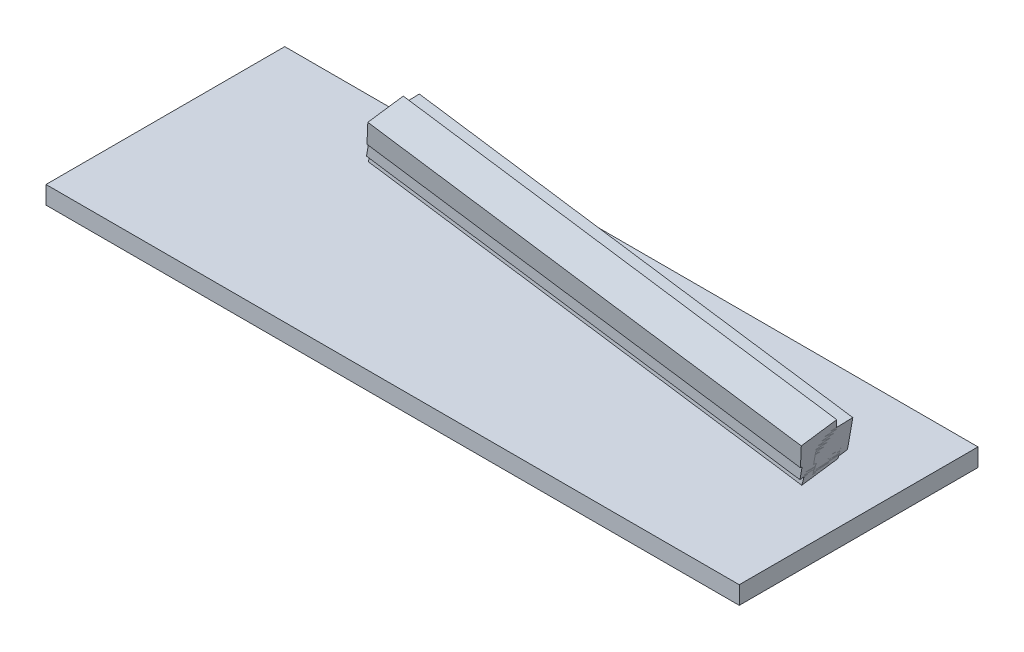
ISO-10303-21;
HEADER;
FILE_DESCRIPTION(('STEP AP214'),'2;1');
FILE_NAME('part.step','',(''),(''),'','','');
FILE_SCHEMA(('AUTOMOTIVE_DESIGN { 1 0 10303 214 1 1 1 1 }'));
ENDSEC;
DATA;
#1=APPLICATION_CONTEXT('core data for automotive mechanical design processes');
#2=APPLICATION_PROTOCOL_DEFINITION('international standard','automotive_design',2000,#1);
#3=PRODUCT_CONTEXT('',#1,'mechanical');
#4=PRODUCT('Part','Part','',(#3));
#5=PRODUCT_RELATED_PRODUCT_CATEGORY('part','',(#4));
#6=PRODUCT_DEFINITION_FORMATION('','',#4);
#7=PRODUCT_DEFINITION_CONTEXT('part definition',#1,'design');
#8=PRODUCT_DEFINITION('design','',#6,#7);
#9=PRODUCT_DEFINITION_SHAPE('','',#8);
#10=(LENGTH_UNIT() NAMED_UNIT(*) SI_UNIT(.MILLI.,.METRE.));
#11=(NAMED_UNIT(*) PLANE_ANGLE_UNIT() SI_UNIT($,.RADIAN.));
#12=(NAMED_UNIT(*) SI_UNIT($,.STERADIAN.) SOLID_ANGLE_UNIT());
#13=UNCERTAINTY_MEASURE_WITH_UNIT(LENGTH_MEASURE(1.E-05),#10,'distance_accuracy_value','');
#14=(GEOMETRIC_REPRESENTATION_CONTEXT(3) GLOBAL_UNCERTAINTY_ASSIGNED_CONTEXT((#13)) GLOBAL_UNIT_ASSIGNED_CONTEXT((#10,
#11,#12)) REPRESENTATION_CONTEXT('',''));
#15=CARTESIAN_POINT('',(0.,0.,0.));
#16=DIRECTION('',(0.,0.,1.));
#17=DIRECTION('',(1.,0.,0.));
#18=AXIS2_PLACEMENT_3D('',#15,#16,#17);
#19=CARTESIAN_POINT('',(-120.032555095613,15.812526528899,2.87336814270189));
#20=DIRECTION('',(-0.0706290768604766,-0.269518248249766,-0.960401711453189));
#21=DIRECTION('',(0.,0.962806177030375,-0.270193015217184));
#22=AXIS2_PLACEMENT_3D('',#19,#20,#21);
#23=PLANE('',#22);
#24=DIRECTION('',(0.15863550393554,0.947517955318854,-0.277568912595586));
#25=VECTOR('',#24,1.);
#26=CARTESIAN_POINT('',(-1.85562473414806,-4.82246293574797,-0.0266905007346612));
#27=LINE('',#26,#25);
#28=CARTESIAN_POINT('',(-2.33644893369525,-7.69438978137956,0.814620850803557));
#29=VERTEX_POINT('',#28);
#30=CARTESIAN_POINT('',(-1.85562473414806,-4.82246293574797,-0.0266905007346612));
#31=VERTEX_POINT('',#30);
#32=EDGE_CURVE('E137',#29,#31,#27,.T.);
#33=ORIENTED_EDGE('',*,*,#32,.T.);
#34=DIRECTION('',(0.984807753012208,-0.171958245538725,-0.0241671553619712));
#35=VECTOR('',#34,1.);
#36=CARTESIAN_POINT('',(-120.032555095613,15.812526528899,2.87336814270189));
#37=LINE('',#36,#35);
#38=CARTESIAN_POINT('',(-120.032555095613,15.812526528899,2.87336814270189));
#39=VERTEX_POINT('',#38);
#40=EDGE_CURVE('E13',#39,#31,#37,.T.);
#41=ORIENTED_EDGE('',*,*,#40,.F.);
#42=DIRECTION('',(0.15863550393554,0.947517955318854,-0.277568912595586));
#43=VECTOR('',#42,1.);
#44=CARTESIAN_POINT('',(-120.032555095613,15.812526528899,2.87336814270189));
#45=LINE('',#44,#43);
#46=CARTESIAN_POINT('',(-120.51337929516,12.9405996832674,3.71467949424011));
#47=VERTEX_POINT('',#46);
#48=EDGE_CURVE('E147',#47,#39,#45,.T.);
#49=ORIENTED_EDGE('',*,*,#48,.F.);
#50=DIRECTION('',(0.984807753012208,-0.171958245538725,-0.0241671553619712));
#51=VECTOR('',#50,1.);
#52=CARTESIAN_POINT('',(-120.51337929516,12.9405996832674,3.71467949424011));
#53=LINE('',#52,#51);
#54=EDGE_CURVE('E133',#47,#29,#53,.T.);
#55=ORIENTED_EDGE('',*,*,#54,.T.);
#56=EDGE_LOOP('',(#33,#41,#49,#55));
#57=FACE_BOUND('',#56,.T.);
#58=ADVANCED_FACE('F53',(#57),#23,.F.);
#59=CARTESIAN_POINT('',(-119.971169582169,16.0467716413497,3.70807751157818));
#60=DIRECTION('',(0.15863550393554,0.947517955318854,-0.277568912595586));
#61=DIRECTION('',(0.,0.281128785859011,0.959670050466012));
#62=AXIS2_PLACEMENT_3D('',#59,#60,#61);
#63=PLANE('',#62);
#64=DIRECTION('',(0.0706290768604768,0.269518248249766,0.960401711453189));
#65=VECTOR('',#64,1.);
#66=CARTESIAN_POINT('',(-1.79423922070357,-4.58821782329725,0.808018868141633));
#67=LINE('',#66,#65);
#68=CARTESIAN_POINT('',(-1.79423922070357,-4.58821782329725,0.808018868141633));
#69=VERTEX_POINT('',#68);
#70=EDGE_CURVE('E140',#31,#69,#67,.T.);
#71=ORIENTED_EDGE('',*,*,#70,.T.);
#72=DIRECTION('',(0.984807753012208,-0.171958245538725,-0.0241671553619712));
#73=VECTOR('',#72,1.);
#74=CARTESIAN_POINT('',(-119.971169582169,16.0467716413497,3.70807751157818));
#75=LINE('',#74,#73);
#76=CARTESIAN_POINT('',(-119.971169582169,16.0467716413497,3.70807751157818));
#77=VERTEX_POINT('',#76);
#78=EDGE_CURVE('E61',#77,#69,#75,.T.);
#79=ORIENTED_EDGE('',*,*,#78,.F.);
#80=DIRECTION('',(0.0706290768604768,0.269518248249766,0.960401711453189));
#81=VECTOR('',#80,1.);
#82=CARTESIAN_POINT('',(-119.971169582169,16.0467716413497,3.70807751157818));
#83=LINE('',#82,#81);
#84=EDGE_CURVE('E106',#39,#77,#83,.T.);
#85=ORIENTED_EDGE('',*,*,#84,.F.);
#86=ORIENTED_EDGE('',*,*,#40,.T.);
#87=EDGE_LOOP('',(#71,#79,#85,#86));
#88=FACE_BOUND('',#87,.T.);
#89=ADVANCED_FACE('F171',(#88),#63,.F.);
#90=CARTESIAN_POINT('',(-118.793796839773,22.7916198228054,3.69374174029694));
#91=DIRECTION('',(-0.0241671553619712,0.00209377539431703,-0.999705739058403));
#92=DIRECTION('',(-0.999707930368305,0.,0.024167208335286));
#93=AXIS2_PLACEMENT_3D('',#90,#91,#92);
#94=PLANE('',#93);
#95=DIRECTION('',(0.171958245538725,0.985102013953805,-0.00209377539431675));
#96=VECTOR('',#95,1.);
#97=CARTESIAN_POINT('',(-0.616866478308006,2.15663035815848,0.79368309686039));
#98=LINE('',#97,#96);
#99=CARTESIAN_POINT('',(-0.616866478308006,2.15663035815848,0.79368309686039));
#100=VERTEX_POINT('',#99);
#101=EDGE_CURVE('E142',#69,#100,#98,.T.);
#102=ORIENTED_EDGE('',*,*,#101,.T.);
#103=DIRECTION('',(0.984807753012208,-0.171958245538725,-0.0241671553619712));
#104=VECTOR('',#103,1.);
#105=CARTESIAN_POINT('',(-118.793796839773,22.7916198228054,3.69374174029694));
#106=LINE('',#105,#104);
#107=CARTESIAN_POINT('',(-118.793796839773,22.7916198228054,3.69374174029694));
#108=VERTEX_POINT('',#107);
#109=EDGE_CURVE('E128',#108,#100,#106,.T.);
#110=ORIENTED_EDGE('',*,*,#109,.F.);
#111=DIRECTION('',(0.171958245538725,0.985102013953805,-0.00209377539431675));
#112=VECTOR('',#111,1.);
#113=CARTESIAN_POINT('',(-118.793796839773,22.7916198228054,3.69374174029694));
#114=LINE('',#113,#112);
#115=EDGE_CURVE('E119',#77,#108,#114,.T.);
#116=ORIENTED_EDGE('',*,*,#115,.F.);
#117=ORIENTED_EDGE('',*,*,#78,.T.);
#118=EDGE_LOOP('',(#102,#110,#116,#117));
#119=FACE_BOUND('',#118,.T.);
#120=ADVANCED_FACE('F153',(#119),#94,.F.);
#121=CARTESIAN_POINT('',(-119.035468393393,22.8125575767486,-6.30331565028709));
#122=DIRECTION('',(-0.171958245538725,-0.985102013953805,0.00209377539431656));
#123=DIRECTION('',(0.985104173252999,-0.171958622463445,0.));
#124=AXIS2_PLACEMENT_3D('',#121,#122,#123);
#125=PLANE('',#124);
#126=DIRECTION('',(-0.0241671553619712,0.00209377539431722,-0.999705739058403));
#127=VECTOR('',#126,1.);
#128=CARTESIAN_POINT('',(-0.858538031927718,2.17756811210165,-9.20337429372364));
#129=LINE('',#128,#127);
#130=CARTESIAN_POINT('',(-0.858538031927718,2.17756811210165,-9.20337429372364));
#131=VERTEX_POINT('',#130);
#132=EDGE_CURVE('E127',#100,#131,#129,.T.);
#133=ORIENTED_EDGE('',*,*,#132,.T.);
#134=DIRECTION('',(0.984807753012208,-0.171958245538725,-0.0241671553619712));
#135=VECTOR('',#134,1.);
#136=CARTESIAN_POINT('',(-119.035468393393,22.8125575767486,-6.30331565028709));
#137=LINE('',#136,#135);
#138=CARTESIAN_POINT('',(-119.035468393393,22.8125575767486,-6.30331565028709));
#139=VERTEX_POINT('',#138);
#140=EDGE_CURVE('E124',#139,#131,#137,.T.);
#141=ORIENTED_EDGE('',*,*,#140,.F.);
#142=DIRECTION('',(-0.0241671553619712,0.00209377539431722,-0.999705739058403));
#143=VECTOR('',#142,1.);
#144=CARTESIAN_POINT('',(-119.035468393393,22.8125575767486,-6.30331565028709));
#145=LINE('',#144,#143);
#146=EDGE_CURVE('E113',#108,#139,#145,.T.);
#147=ORIENTED_EDGE('',*,*,#146,.F.);
#148=ORIENTED_EDGE('',*,*,#109,.T.);
#149=EDGE_LOOP('',(#133,#141,#147,#148));
#150=FACE_BOUND('',#149,.T.);
#151=ADVANCED_FACE('F125',(#150),#125,.F.);
#152=CARTESIAN_POINT('',(-120.51337929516,14.3460080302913,-6.28532050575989));
#153=DIRECTION('',(0.0241671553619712,-0.0020937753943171,0.999705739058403));
#154=DIRECTION('',(0.999707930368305,0.,-0.024167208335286));
#155=AXIS2_PLACEMENT_3D('',#152,#153,#154);
#156=PLANE('',#155);
#157=DIRECTION('',(-0.171958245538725,-0.985102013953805,0.00209377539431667));
#158=VECTOR('',#157,1.);
#159=CARTESIAN_POINT('',(-2.33644893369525,-6.28898143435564,-9.18537914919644));
#160=LINE('',#159,#158);
#161=CARTESIAN_POINT('',(-2.33644893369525,-6.28898143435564,-9.18537914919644));
#162=VERTEX_POINT('',#161);
#163=EDGE_CURVE('E92',#131,#162,#160,.T.);
#164=ORIENTED_EDGE('',*,*,#163,.T.);
#165=DIRECTION('',(0.984807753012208,-0.171958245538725,-0.0241671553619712));
#166=VECTOR('',#165,1.);
#167=CARTESIAN_POINT('',(-120.51337929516,14.3460080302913,-6.28532050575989));
#168=LINE('',#167,#166);
#169=CARTESIAN_POINT('',(-120.51337929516,14.3460080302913,-6.28532050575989));
#170=VERTEX_POINT('',#169);
#171=EDGE_CURVE('E129',#170,#162,#168,.T.);
#172=ORIENTED_EDGE('',*,*,#171,.F.);
#173=DIRECTION('',(-0.171958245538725,-0.985102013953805,0.00209377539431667));
#174=VECTOR('',#173,1.);
#175=CARTESIAN_POINT('',(-120.51337929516,14.3460080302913,-6.28532050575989));
#176=LINE('',#175,#174);
#177=EDGE_CURVE('E117',#139,#170,#176,.T.);
#178=ORIENTED_EDGE('',*,*,#177,.F.);
#179=ORIENTED_EDGE('',*,*,#140,.T.);
#180=EDGE_LOOP('',(#164,#172,#178,#179));
#181=FACE_BOUND('',#180,.T.);
#182=ADVANCED_FACE('F131',(#181),#156,.F.);
#183=CARTESIAN_POINT('',(-120.51337929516,12.9405996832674,3.71467949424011));
#184=DIRECTION('',(0.173648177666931,0.975223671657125,0.137058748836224));
#185=DIRECTION('',(-0.984514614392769,0.175302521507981,0.));
#186=AXIS2_PLACEMENT_3D('',#183,#184,#185);
#187=PLANE('',#186);
#188=DIRECTION('',(0.,-0.139173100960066,0.99026806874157));
#189=VECTOR('',#188,1.);
#190=CARTESIAN_POINT('',(-2.33644893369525,-7.69438978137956,0.814620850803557));
#191=LINE('',#190,#189);
#192=EDGE_CURVE('E98',#162,#29,#191,.T.);
#193=ORIENTED_EDGE('',*,*,#192,.T.);
#194=ORIENTED_EDGE('',*,*,#54,.F.);
#195=DIRECTION('',(0.,-0.139173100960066,0.99026806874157));
#196=VECTOR('',#195,1.);
#197=CARTESIAN_POINT('',(-120.51337929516,12.9405996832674,3.71467949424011));
#198=LINE('',#197,#196);
#199=EDGE_CURVE('E69',#170,#47,#198,.T.);
#200=ORIENTED_EDGE('',*,*,#199,.F.);
#201=ORIENTED_EDGE('',*,*,#171,.T.);
#202=EDGE_LOOP('',(#193,#194,#200,#201));
#203=FACE_BOUND('',#202,.T.);
#204=ADVANCED_FACE('F160',(#203),#187,.F.);
#205=CARTESIAN_POINT('',(-119.159302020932,20.8065223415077,2.92416601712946));
#206=DIRECTION('',(0.984807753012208,-0.171958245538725,-0.0241671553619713));
#207=DIRECTION('',(0.172008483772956,0.985095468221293,0.));
#208=AXIS2_PLACEMENT_3D('',#205,#206,#207);
#209=PLANE('',#208);
#210=ORIENTED_EDGE('',*,*,#48,.T.);
#211=ORIENTED_EDGE('',*,*,#84,.T.);
#212=ORIENTED_EDGE('',*,*,#115,.T.);
#213=ORIENTED_EDGE('',*,*,#146,.T.);
#214=ORIENTED_EDGE('',*,*,#177,.T.);
#215=ORIENTED_EDGE('',*,*,#199,.T.);
#216=EDGE_LOOP('',(#210,#211,#212,#213,#214,#215));
#217=FACE_BOUND('',#216,.T.);
#218=ADVANCED_FACE('F115',(#217),#209,.F.);
#219=CARTESIAN_POINT('',(-0.982371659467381,0.171532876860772,0.0241073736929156));
#220=DIRECTION('',(0.984807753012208,-0.171958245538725,-0.0241671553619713));
#221=DIRECTION('',(0.172008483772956,0.985095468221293,0.));
#222=AXIS2_PLACEMENT_3D('',#219,#220,#221);
#223=PLANE('',#222);
#224=ORIENTED_EDGE('',*,*,#32,.F.);
#225=ORIENTED_EDGE('',*,*,#192,.F.);
#226=ORIENTED_EDGE('',*,*,#163,.F.);
#227=ORIENTED_EDGE('',*,*,#132,.F.);
#228=ORIENTED_EDGE('',*,*,#101,.F.);
#229=ORIENTED_EDGE('',*,*,#70,.F.);
#230=EDGE_LOOP('',(#224,#225,#226,#227,#228,#229));
#231=FACE_BOUND('',#230,.T.);
#232=ADVANCED_FACE('F156',(#231),#223,.T.);
#233=CLOSED_SHELL('',(#58,#89,#120,#151,#182,#204,#218,#232));
#234=MANIFOLD_SOLID_BREP('B2_NOT_SHOWN',#233);
#235=CARTESIAN_POINT('',(11.5365436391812,-15.,34.9080318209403));
#236=DIRECTION('',(1.,0.,0.));
#237=DIRECTION('',(0.,0.,-1.));
#238=AXIS2_PLACEMENT_3D('',#235,#236,#237);
#239=PLANE('',#238);
#240=DIRECTION('',(0.,0.,-1.));
#241=VECTOR('',#240,1.);
#242=CARTESIAN_POINT('',(11.5365436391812,-10.,34.9080318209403));
#243=LINE('',#242,#241);
#244=CARTESIAN_POINT('',(11.5365436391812,-10.,34.9080318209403));
#245=VERTEX_POINT('',#244);
#246=CARTESIAN_POINT('',(11.5365436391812,-10.,-31.7779336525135));
#247=VERTEX_POINT('',#246);
#248=EDGE_CURVE('E309',#245,#247,#243,.T.);
#249=ORIENTED_EDGE('',*,*,#248,.F.);
#250=DIRECTION('',(0.,1.,0.));
#251=VECTOR('',#250,1.);
#252=CARTESIAN_POINT('',(11.5365436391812,-15.,34.9080318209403));
#253=LINE('',#252,#251);
#254=CARTESIAN_POINT('',(11.5365436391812,-15.,34.9080318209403));
#255=VERTEX_POINT('',#254);
#256=EDGE_CURVE('E51',#255,#245,#253,.T.);
#257=ORIENTED_EDGE('',*,*,#256,.F.);
#258=DIRECTION('',(0.,0.,-1.));
#259=VECTOR('',#258,1.);
#260=CARTESIAN_POINT('',(11.5365436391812,-15.,34.9080318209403));
#261=LINE('',#260,#259);
#262=CARTESIAN_POINT('',(11.5365436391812,-15.,-31.7779336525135));
#263=VERTEX_POINT('',#262);
#264=EDGE_CURVE('E301',#255,#263,#261,.T.);
#265=ORIENTED_EDGE('',*,*,#264,.T.);
#266=DIRECTION('',(0.,1.,0.));
#267=VECTOR('',#266,1.);
#268=CARTESIAN_POINT('',(11.5365436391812,-15.,-31.7779336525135));
#269=LINE('',#268,#267);
#270=EDGE_CURVE('E242',#263,#247,#269,.T.);
#271=ORIENTED_EDGE('',*,*,#270,.T.);
#272=EDGE_LOOP('',(#249,#257,#265,#271));
#273=FACE_BOUND('',#272,.T.);
#274=ADVANCED_FACE('F239',(#273),#239,.T.);
#275=CARTESIAN_POINT('',(-182.098464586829,-15.,34.9080318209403));
#276=DIRECTION('',(0.,0.,1.));
#277=DIRECTION('',(1.,0.,0.));
#278=AXIS2_PLACEMENT_3D('',#275,#276,#277);
#279=PLANE('',#278);
#280=DIRECTION('',(1.,0.,0.));
#281=VECTOR('',#280,1.);
#282=CARTESIAN_POINT('',(-182.098464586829,-10.,34.9080318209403));
#283=LINE('',#282,#281);
#284=CARTESIAN_POINT('',(-182.098464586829,-10.,34.9080318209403));
#285=VERTEX_POINT('',#284);
#286=EDGE_CURVE('E304',#285,#245,#283,.T.);
#287=ORIENTED_EDGE('',*,*,#286,.F.);
#288=DIRECTION('',(0.,1.,0.));
#289=VECTOR('',#288,1.);
#290=CARTESIAN_POINT('',(-182.098464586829,-15.,34.9080318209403));
#291=LINE('',#290,#289);
#292=CARTESIAN_POINT('',(-182.098464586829,-15.,34.9080318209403));
#293=VERTEX_POINT('',#292);
#294=EDGE_CURVE('E249',#293,#285,#291,.T.);
#295=ORIENTED_EDGE('',*,*,#294,.F.);
#296=DIRECTION('',(1.,0.,0.));
#297=VECTOR('',#296,1.);
#298=CARTESIAN_POINT('',(-182.098464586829,-15.,34.9080318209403));
#299=LINE('',#298,#297);
#300=EDGE_CURVE('E296',#293,#255,#299,.T.);
#301=ORIENTED_EDGE('',*,*,#300,.T.);
#302=ORIENTED_EDGE('',*,*,#256,.T.);
#303=EDGE_LOOP('',(#287,#295,#301,#302));
#304=FACE_BOUND('',#303,.T.);
#305=ADVANCED_FACE('F325',(#304),#279,.T.);
#306=CARTESIAN_POINT('',(-182.098464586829,-15.,34.9080318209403));
#307=DIRECTION('',(-1.,0.,0.));
#308=DIRECTION('',(0.,0.,1.));
#309=AXIS2_PLACEMENT_3D('',#306,#307,#308);
#310=PLANE('',#309);
#311=DIRECTION('',(0.,0.,1.));
#312=VECTOR('',#311,1.);
#313=CARTESIAN_POINT('',(-182.098464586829,-10.,34.9080318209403));
#314=LINE('',#313,#312);
#315=CARTESIAN_POINT('',(-182.098464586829,-10.,-31.7779336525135));
#316=VERTEX_POINT('',#315);
#317=EDGE_CURVE('E290',#316,#285,#314,.T.);
#318=ORIENTED_EDGE('',*,*,#317,.F.);
#319=DIRECTION('',(0.,1.,0.));
#320=VECTOR('',#319,1.);
#321=CARTESIAN_POINT('',(-182.098464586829,-15.,-31.7779336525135));
#322=LINE('',#321,#320);
#323=CARTESIAN_POINT('',(-182.098464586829,-15.,-31.7779336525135));
#324=VERTEX_POINT('',#323);
#325=EDGE_CURVE('E285',#324,#316,#322,.T.);
#326=ORIENTED_EDGE('',*,*,#325,.F.);
#327=DIRECTION('',(0.,0.,1.));
#328=VECTOR('',#327,1.);
#329=CARTESIAN_POINT('',(-182.098464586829,-15.,34.9080318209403));
#330=LINE('',#329,#328);
#331=EDGE_CURVE('E288',#324,#293,#330,.T.);
#332=ORIENTED_EDGE('',*,*,#331,.T.);
#333=ORIENTED_EDGE('',*,*,#294,.T.);
#334=EDGE_LOOP('',(#318,#326,#332,#333));
#335=FACE_BOUND('',#334,.T.);
#336=ADVANCED_FACE('F287',(#335),#310,.T.);
#337=CARTESIAN_POINT('',(-182.098464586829,-15.,-31.7779336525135));
#338=DIRECTION('',(0.,0.,-1.));
#339=DIRECTION('',(-1.,0.,0.));
#340=AXIS2_PLACEMENT_3D('',#337,#338,#339);
#341=PLANE('',#340);
#342=DIRECTION('',(-1.,0.,0.));
#343=VECTOR('',#342,1.);
#344=CARTESIAN_POINT('',(-182.098464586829,-10.,-31.7779336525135));
#345=LINE('',#344,#343);
#346=EDGE_CURVE('E313',#247,#316,#345,.T.);
#347=ORIENTED_EDGE('',*,*,#346,.F.);
#348=ORIENTED_EDGE('',*,*,#270,.F.);
#349=DIRECTION('',(-1.,0.,0.));
#350=VECTOR('',#349,1.);
#351=CARTESIAN_POINT('',(-182.098464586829,-15.,-31.7779336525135));
#352=LINE('',#351,#350);
#353=EDGE_CURVE('E295',#263,#324,#352,.T.);
#354=ORIENTED_EDGE('',*,*,#353,.T.);
#355=ORIENTED_EDGE('',*,*,#325,.T.);
#356=EDGE_LOOP('',(#347,#348,#354,#355));
#357=FACE_BOUND('',#356,.T.);
#358=ADVANCED_FACE('F299',(#357),#341,.T.);
#359=CARTESIAN_POINT('',(0.,-15.,0.));
#360=DIRECTION('',(0.,-1.,0.));
#361=DIRECTION('',(0.,0.,-1.));
#362=AXIS2_PLACEMENT_3D('',#359,#360,#361);
#363=PLANE('',#362);
#364=ORIENTED_EDGE('',*,*,#264,.F.);
#365=ORIENTED_EDGE('',*,*,#300,.F.);
#366=ORIENTED_EDGE('',*,*,#331,.F.);
#367=ORIENTED_EDGE('',*,*,#353,.F.);
#368=EDGE_LOOP('',(#364,#365,#366,#367));
#369=FACE_BOUND('',#368,.T.);
#370=ADVANCED_FACE('F294',(#369),#363,.T.);
#371=CARTESIAN_POINT('',(0.,-10.,0.));
#372=DIRECTION('',(0.,-1.,0.));
#373=DIRECTION('',(0.,0.,-1.));
#374=AXIS2_PLACEMENT_3D('',#371,#372,#373);
#375=PLANE('',#374);
#376=ORIENTED_EDGE('',*,*,#248,.T.);
#377=ORIENTED_EDGE('',*,*,#346,.T.);
#378=ORIENTED_EDGE('',*,*,#317,.T.);
#379=ORIENTED_EDGE('',*,*,#286,.T.);
#380=EDGE_LOOP('',(#376,#377,#378,#379));
#381=FACE_BOUND('',#380,.T.);
#382=ADVANCED_FACE('F324',(#381),#375,.F.);
#383=CLOSED_SHELL('',(#274,#305,#336,#358,#370,#382));
#384=MANIFOLD_SOLID_BREP('B7',#383);
#385=CARTESIAN_POINT('',(-119.426327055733,20.3826632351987,-4.941147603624));
#386=DIRECTION('',(0.0524373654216,0.161816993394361,0.985426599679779));
#387=DIRECTION('',(0.,-0.98678420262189,0.162039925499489));
#388=AXIS2_PLACEMENT_3D('',#385,#386,#387);
#389=PLANE('',#388);
#390=DIRECTION('',(0.984807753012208,-0.171958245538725,-0.0241671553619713));
#391=VECTOR('',#390,1.);
#392=CARTESIAN_POINT('',(-120.616269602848,13.3977437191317,-3.73083307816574));
#393=LINE('',#392,#391);
#394=CARTESIAN_POINT('',(-120.616269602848,13.3977437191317,-3.73083307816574));
#395=VERTEX_POINT('',#394);
#396=CARTESIAN_POINT('',(-2.43933924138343,-7.23724574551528,-6.63089172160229));
#397=VERTEX_POINT('',#396);
#398=EDGE_CURVE('E398',#395,#397,#393,.T.);
#399=ORIENTED_EDGE('',*,*,#398,.F.);
#400=DIRECTION('',(-0.165541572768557,-0.97172301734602,0.168375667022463));
#401=VECTOR('',#400,1.);
#402=CARTESIAN_POINT('',(-119.426327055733,20.3826632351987,-4.941147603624));
#403=LINE('',#402,#401);
#404=CARTESIAN_POINT('',(-119.426327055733,20.3826632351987,-4.941147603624));
#405=VERTEX_POINT('',#404);
#406=EDGE_CURVE('E446',#405,#395,#403,.T.);
#407=ORIENTED_EDGE('',*,*,#406,.F.);
#408=DIRECTION('',(0.984807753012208,-0.171958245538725,-0.0241671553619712));
#409=VECTOR('',#408,1.);
#410=CARTESIAN_POINT('',(-119.426327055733,20.3826632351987,-4.941147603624));
#411=LINE('',#410,#409);
#412=CARTESIAN_POINT('',(-1.24939669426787,-0.252326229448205,-7.84120624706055));
#413=VERTEX_POINT('',#412);
#414=EDGE_CURVE('E237',#405,#413,#411,.T.);
#415=ORIENTED_EDGE('',*,*,#414,.T.);
#416=DIRECTION('',(-0.165541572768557,-0.97172301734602,0.168375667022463));
#417=VECTOR('',#416,1.);
#418=CARTESIAN_POINT('',(-1.24939669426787,-0.252326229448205,-7.84120624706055));
#419=LINE('',#418,#417);
#420=EDGE_CURVE('E431',#413,#397,#419,.T.);
#421=ORIENTED_EDGE('',*,*,#420,.T.);
#422=EDGE_LOOP('',(#399,#407,#415,#421));
#423=FACE_BOUND('',#422,.T.);
#424=ADVANCED_FACE('F383',(#423),#389,.F.);
#425=CARTESIAN_POINT('',(-119.159302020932,20.8065223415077,2.92416601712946));
#426=DIRECTION('',(-0.984807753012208,0.171958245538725,0.0241671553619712));
#427=DIRECTION('',(-0.172008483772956,-0.985095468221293,0.));
#428=AXIS2_PLACEMENT_3D('',#425,#426,#427);
#429=PLANE('',#428);
#430=ORIENTED_EDGE('',*,*,#406,.T.);
#431=DIRECTION('',(0.,0.139173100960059,-0.990268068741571));
#432=VECTOR('',#431,1.);
#433=CARTESIAN_POINT('',(-120.616269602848,12.6240623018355,1.77419625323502));
#434=LINE('',#433,#432);
#435=CARTESIAN_POINT('',(-120.616269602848,11.9785540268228,6.36722628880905));
#436=VERTEX_POINT('',#435);
#437=EDGE_CURVE('E442',#436,#395,#434,.T.);
#438=ORIENTED_EDGE('',*,*,#437,.F.);
#439=DIRECTION('',(0.166921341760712,0.975806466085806,-0.141205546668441));
#440=VECTOR('',#439,1.);
#441=CARTESIAN_POINT('',(-118.947687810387,21.7329262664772,4.95570513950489));
#442=LINE('',#441,#440);
#443=CARTESIAN_POINT('',(-118.947687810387,21.7329262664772,4.95570513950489));
#444=VERTEX_POINT('',#443);
#445=EDGE_CURVE('E407',#436,#444,#442,.T.);
#446=ORIENTED_EDGE('',*,*,#445,.T.);
#447=DIRECTION('',(-0.0478639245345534,-0.135026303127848,-0.989685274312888));
#448=VECTOR('',#447,1.);
#449=CARTESIAN_POINT('',(-118.947687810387,21.7329262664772,4.95570513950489));
#450=LINE('',#449,#448);
#451=EDGE_CURVE('E430',#444,#405,#450,.T.);
#452=ORIENTED_EDGE('',*,*,#451,.T.);
#453=EDGE_LOOP('',(#430,#438,#446,#452));
#454=FACE_BOUND('',#453,.T.);
#455=ADVANCED_FACE('F456',(#454),#429,.T.);
#456=CARTESIAN_POINT('',(-0.982371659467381,0.171532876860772,0.0241073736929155));
#457=DIRECTION('',(-0.984807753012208,0.171958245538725,0.0241671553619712));
#458=DIRECTION('',(-0.172008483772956,-0.985095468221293,0.));
#459=AXIS2_PLACEMENT_3D('',#456,#457,#458);
#460=PLANE('',#459);
#461=DIRECTION('',(0.,0.139173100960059,-0.990268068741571));
#462=VECTOR('',#461,1.);
#463=CARTESIAN_POINT('',(-2.43933924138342,-8.01092716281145,-1.12586239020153));
#464=LINE('',#463,#462);
#465=CARTESIAN_POINT('',(-2.43933924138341,-8.65643543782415,3.4671676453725));
#466=VERTEX_POINT('',#465);
#467=EDGE_CURVE('E450',#466,#397,#464,.T.);
#468=ORIENTED_EDGE('',*,*,#467,.T.);
#469=ORIENTED_EDGE('',*,*,#420,.F.);
#470=DIRECTION('',(-0.0478639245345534,-0.135026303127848,-0.989685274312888));
#471=VECTOR('',#470,1.);
#472=CARTESIAN_POINT('',(-0.770757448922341,1.09793680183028,2.05564649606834));
#473=LINE('',#472,#471);
#474=CARTESIAN_POINT('',(-0.770757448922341,1.09793680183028,2.05564649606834));
#475=VERTEX_POINT('',#474);
#476=EDGE_CURVE('E436',#475,#413,#473,.T.);
#477=ORIENTED_EDGE('',*,*,#476,.F.);
#478=DIRECTION('',(0.166921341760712,0.975806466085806,-0.141205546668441));
#479=VECTOR('',#478,1.);
#480=CARTESIAN_POINT('',(-0.770757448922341,1.09793680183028,2.05564649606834));
#481=LINE('',#480,#479);
#482=EDGE_CURVE('E421',#466,#475,#481,.T.);
#483=ORIENTED_EDGE('',*,*,#482,.F.);
#484=EDGE_LOOP('',(#468,#469,#477,#483));
#485=FACE_BOUND('',#484,.T.);
#486=ADVANCED_FACE('F438',(#485),#460,.F.);
#487=CARTESIAN_POINT('',(-118.947687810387,21.7329262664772,4.95570513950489));
#488=DIRECTION('',(-0.166921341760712,-0.975806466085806,0.141205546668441));
#489=DIRECTION('',(0.985682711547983,-0.168610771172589,0.));
#490=AXIS2_PLACEMENT_3D('',#487,#488,#489);
#491=PLANE('',#490);
#492=ORIENTED_EDGE('',*,*,#476,.T.);
#493=ORIENTED_EDGE('',*,*,#414,.F.);
#494=ORIENTED_EDGE('',*,*,#451,.F.);
#495=DIRECTION('',(0.984807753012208,-0.171958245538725,-0.0241671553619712));
#496=VECTOR('',#495,1.);
#497=CARTESIAN_POINT('',(-118.947687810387,21.7329262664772,4.95570513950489));
#498=LINE('',#497,#496);
#499=EDGE_CURVE('E424',#444,#475,#498,.T.);
#500=ORIENTED_EDGE('',*,*,#499,.T.);
#501=EDGE_LOOP('',(#492,#493,#494,#500));
#502=FACE_BOUND('',#501,.T.);
#503=ADVANCED_FACE('F385',(#502),#491,.F.);
#504=CARTESIAN_POINT('',(-118.947687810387,21.7329262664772,4.95570513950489));
#505=DIRECTION('',(-0.0478639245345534,-0.135026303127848,-0.989685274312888));
#506=DIRECTION('',(0.,0.990820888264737,-0.135181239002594));
#507=AXIS2_PLACEMENT_3D('',#504,#505,#506);
#508=PLANE('',#507);
#509=ORIENTED_EDGE('',*,*,#482,.T.);
#510=ORIENTED_EDGE('',*,*,#499,.F.);
#511=ORIENTED_EDGE('',*,*,#445,.F.);
#512=DIRECTION('',(0.984807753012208,-0.171958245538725,-0.0241671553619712));
#513=VECTOR('',#512,1.);
#514=CARTESIAN_POINT('',(-120.616269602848,11.9785540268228,6.36722628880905));
#515=LINE('',#514,#513);
#516=EDGE_CURVE('E391',#436,#466,#515,.T.);
#517=ORIENTED_EDGE('',*,*,#516,.T.);
#518=EDGE_LOOP('',(#509,#510,#511,#517));
#519=FACE_BOUND('',#518,.T.);
#520=ADVANCED_FACE('F423',(#519),#508,.F.);
#521=CARTESIAN_POINT('',(-120.616269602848,12.6240623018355,1.77419625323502));
#522=DIRECTION('',(-0.173648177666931,-0.975223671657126,-0.137058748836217));
#523=DIRECTION('',(0.98451461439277,-0.175302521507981,0.));
#524=AXIS2_PLACEMENT_3D('',#521,#522,#523);
#525=PLANE('',#524);
#526=ORIENTED_EDGE('',*,*,#467,.F.);
#527=ORIENTED_EDGE('',*,*,#516,.F.);
#528=ORIENTED_EDGE('',*,*,#437,.T.);
#529=ORIENTED_EDGE('',*,*,#398,.T.);
#530=EDGE_LOOP('',(#526,#527,#528,#529));
#531=FACE_BOUND('',#530,.T.);
#532=ADVANCED_FACE('F452',(#531),#525,.T.);
#533=CLOSED_SHELL('',(#424,#455,#486,#503,#520,#532));
#534=MANIFOLD_SOLID_BREP('B45_NOT_SHOWN',#533);
#535=CARTESIAN_POINT('',(-118.519421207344,23.6733223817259,8.60086560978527));
#536=DIRECTION('',(-0.173648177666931,-0.975223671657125,-0.137058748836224));
#537=DIRECTION('',(0.98451461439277,-0.175302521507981,0.));
#538=AXIS2_PLACEMENT_3D('',#535,#536,#537);
#539=PLANE('',#538);
#540=DIRECTION('',(0.,0.139173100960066,-0.99026806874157));
#541=VECTOR('',#540,1.);
#542=CARTESIAN_POINT('',(-0.342490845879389,3.03833291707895,5.70080696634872));
#543=LINE('',#542,#541);
#544=CARTESIAN_POINT('',(-0.342490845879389,3.03833291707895,5.70080696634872));
#545=VERTEX_POINT('',#544);
#546=CARTESIAN_POINT('',(-0.342490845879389,4.43006392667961,-4.20187372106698));
#547=VERTEX_POINT('',#546);
#548=EDGE_CURVE('E588',#545,#547,#543,.T.);
#549=ORIENTED_EDGE('',*,*,#548,.T.);
#550=DIRECTION('',(0.984807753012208,-0.171958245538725,-0.0241671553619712));
#551=VECTOR('',#550,1.);
#552=CARTESIAN_POINT('',(-118.519421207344,25.0650533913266,-1.30181507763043));
#553=LINE('',#552,#551);
#554=CARTESIAN_POINT('',(-118.519421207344,25.0650533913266,-1.30181507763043));
#555=VERTEX_POINT('',#554);
#556=EDGE_CURVE('E381',#555,#547,#553,.T.);
#557=ORIENTED_EDGE('',*,*,#556,.F.);
#558=DIRECTION('',(0.,0.139173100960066,-0.99026806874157));
#559=VECTOR('',#558,1.);
#560=CARTESIAN_POINT('',(-118.519421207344,23.6733223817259,8.60086560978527));
#561=LINE('',#560,#559);
#562=CARTESIAN_POINT('',(-118.519421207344,23.6733223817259,8.60086560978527));
#563=VERTEX_POINT('',#562);
#564=EDGE_CURVE('E590',#563,#555,#561,.T.);
#565=ORIENTED_EDGE('',*,*,#564,.F.);
#566=DIRECTION('',(0.984807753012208,-0.171958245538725,-0.0241671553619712));
#567=VECTOR('',#566,1.);
#568=CARTESIAN_POINT('',(-118.519421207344,23.6733223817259,8.60086560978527));
#569=LINE('',#568,#567);
#570=EDGE_CURVE('E595',#563,#545,#569,.T.);
#571=ORIENTED_EDGE('',*,*,#570,.T.);
#572=EDGE_LOOP('',(#549,#557,#565,#571));
#573=FACE_BOUND('',#572,.T.);
#574=ADVANCED_FACE('F507',(#573),#539,.F.);
#575=CARTESIAN_POINT('',(-118.519421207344,25.0650533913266,-1.30181507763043));
#576=DIRECTION('',(0.,-0.139173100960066,0.99026806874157));
#577=DIRECTION('',(0.,-0.99026806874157,-0.139173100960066));
#578=AXIS2_PLACEMENT_3D('',#575,#576,#577);
#579=PLANE('',#578);
#580=DIRECTION('',(-0.173648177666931,-0.975223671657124,-0.137058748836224));
#581=VECTOR('',#580,1.);
#582=CARTESIAN_POINT('',(-0.342490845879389,4.43006392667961,-4.20187372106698));
#583=LINE('',#582,#581);
#584=CARTESIAN_POINT('',(-2.0789726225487,-5.32217278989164,-5.57246120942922));
#585=VERTEX_POINT('',#584);
#586=EDGE_CURVE('E598',#547,#585,#583,.T.);
#587=ORIENTED_EDGE('',*,*,#586,.T.);
#588=DIRECTION('',(0.984807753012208,-0.171958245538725,-0.0241671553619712));
#589=VECTOR('',#588,1.);
#590=CARTESIAN_POINT('',(-120.255902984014,15.3128166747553,-2.67240256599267));
#591=LINE('',#590,#589);
#592=CARTESIAN_POINT('',(-120.255902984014,15.3128166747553,-2.67240256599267));
#593=VERTEX_POINT('',#592);
#594=EDGE_CURVE('E514',#593,#585,#591,.T.);
#595=ORIENTED_EDGE('',*,*,#594,.F.);
#596=DIRECTION('',(-0.173648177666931,-0.975223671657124,-0.137058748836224));
#597=VECTOR('',#596,1.);
#598=CARTESIAN_POINT('',(-118.519421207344,25.0650533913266,-1.30181507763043));
#599=LINE('',#598,#597);
#600=EDGE_CURVE('E553',#555,#593,#599,.T.);
#601=ORIENTED_EDGE('',*,*,#600,.F.);
#602=ORIENTED_EDGE('',*,*,#556,.T.);
#603=EDGE_LOOP('',(#587,#595,#601,#602));
#604=FACE_BOUND('',#603,.T.);
#605=ADVANCED_FACE('F617',(#604),#579,.F.);
#606=CARTESIAN_POINT('',(-120.255902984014,13.9210856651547,7.23027812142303));
#607=DIRECTION('',(0.173648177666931,0.975223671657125,0.137058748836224));
#608=DIRECTION('',(-0.98451461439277,0.175302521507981,0.));
#609=AXIS2_PLACEMENT_3D('',#606,#607,#608);
#610=PLANE('',#609);
#611=DIRECTION('',(0.,-0.139173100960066,0.99026806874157));
#612=VECTOR('',#611,1.);
#613=CARTESIAN_POINT('',(-2.0789726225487,-6.71390379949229,4.33021947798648));
#614=LINE('',#613,#612);
#615=CARTESIAN_POINT('',(-2.0789726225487,-6.71390379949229,4.33021947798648));
#616=VERTEX_POINT('',#615);
#617=EDGE_CURVE('E600',#585,#616,#614,.T.);
#618=ORIENTED_EDGE('',*,*,#617,.T.);
#619=DIRECTION('',(0.984807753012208,-0.171958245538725,-0.0241671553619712));
#620=VECTOR('',#619,1.);
#621=CARTESIAN_POINT('',(-120.255902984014,13.9210856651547,7.23027812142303));
#622=LINE('',#621,#620);
#623=CARTESIAN_POINT('',(-120.255902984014,13.9210856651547,7.23027812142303));
#624=VERTEX_POINT('',#623);
#625=EDGE_CURVE('E605',#624,#616,#622,.T.);
#626=ORIENTED_EDGE('',*,*,#625,.F.);
#627=DIRECTION('',(0.,-0.139173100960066,0.99026806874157));
#628=VECTOR('',#627,1.);
#629=CARTESIAN_POINT('',(-120.255902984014,13.9210856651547,7.23027812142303));
#630=LINE('',#629,#628);
#631=EDGE_CURVE('E581',#593,#624,#630,.T.);
#632=ORIENTED_EDGE('',*,*,#631,.F.);
#633=ORIENTED_EDGE('',*,*,#594,.T.);
#634=EDGE_LOOP('',(#618,#626,#632,#633));
#635=FACE_BOUND('',#634,.T.);
#636=ADVANCED_FACE('F609',(#635),#610,.F.);
#637=CARTESIAN_POINT('',(-118.519421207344,23.6733223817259,8.60086560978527));
#638=DIRECTION('',(0.,0.139173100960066,-0.99026806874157));
#639=DIRECTION('',(0.,0.99026806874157,0.139173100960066));
#640=AXIS2_PLACEMENT_3D('',#637,#638,#639);
#641=PLANE('',#640);
#642=DIRECTION('',(0.173648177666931,0.975223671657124,0.137058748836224));
#643=VECTOR('',#642,1.);
#644=CARTESIAN_POINT('',(-118.519421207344,23.6733223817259,8.60086560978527));
#645=LINE('',#644,#643);
#646=CARTESIAN_POINT('',(-119.643408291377,17.3609105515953,7.71371398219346));
#647=VERTEX_POINT('',#646);
#648=EDGE_CURVE('E530',#647,#563,#645,.T.);
#649=ORIENTED_EDGE('',*,*,#648,.F.);
#650=DIRECTION('',(0.984807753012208,-0.171958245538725,-0.0241671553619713));
#651=VECTOR('',#650,1.);
#652=CARTESIAN_POINT('',(-119.643408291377,17.3609105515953,7.71371398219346));
#653=LINE('',#652,#651);
#654=CARTESIAN_POINT('',(-1.46647792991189,-3.27407891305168,4.81365533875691));
#655=VERTEX_POINT('',#654);
#656=EDGE_CURVE('E574',#647,#655,#653,.T.);
#657=ORIENTED_EDGE('',*,*,#656,.T.);
#658=DIRECTION('',(0.173648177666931,0.975223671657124,0.137058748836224));
#659=VECTOR('',#658,1.);
#660=CARTESIAN_POINT('',(-0.342490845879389,3.03833291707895,5.70080696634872));
#661=LINE('',#660,#659);
#662=EDGE_CURVE('E548',#655,#545,#661,.T.);
#663=ORIENTED_EDGE('',*,*,#662,.T.);
#664=ORIENTED_EDGE('',*,*,#570,.F.);
#665=EDGE_LOOP('',(#649,#657,#663,#664));
#666=FACE_BOUND('',#665,.T.);
#667=ADVANCED_FACE('F613',(#666),#641,.F.);
#668=CARTESIAN_POINT('',(-119.159302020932,20.8065223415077,2.92416601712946));
#669=DIRECTION('',(-0.984807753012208,0.171958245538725,0.0241671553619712));
#670=DIRECTION('',(-0.172008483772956,-0.985095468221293,0.));
#671=AXIS2_PLACEMENT_3D('',#668,#669,#670);
#672=PLANE('',#671);
#673=DIRECTION('',(0.171958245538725,0.985102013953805,-0.00209377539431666));
#674=VECTOR('',#673,1.);
#675=CARTESIAN_POINT('',(-119.055558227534,20.7975342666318,7.21566264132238));
#676=LINE('',#675,#674);
#677=CARTESIAN_POINT('',(-119.655271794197,17.3619383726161,7.22296479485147));
#678=VERTEX_POINT('',#677);
#679=EDGE_CURVE('E570',#624,#678,#676,.T.);
#680=ORIENTED_EDGE('',*,*,#679,.T.);
#681=DIRECTION('',(0.0241671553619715,-0.00209377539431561,0.999705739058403));
#682=VECTOR('',#681,1.);
#683=CARTESIAN_POINT('',(-119.759015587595,17.370926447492,2.93146817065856));
#684=LINE('',#683,#682);
#685=EDGE_CURVE('E575',#678,#647,#684,.T.);
#686=ORIENTED_EDGE('',*,*,#685,.T.);
#687=ORIENTED_EDGE('',*,*,#648,.T.);
#688=ORIENTED_EDGE('',*,*,#564,.T.);
#689=ORIENTED_EDGE('',*,*,#600,.T.);
#690=ORIENTED_EDGE('',*,*,#631,.T.);
#691=EDGE_LOOP('',(#680,#686,#687,#688,#689,#690));
#692=FACE_BOUND('',#691,.T.);
#693=ADVANCED_FACE('F579',(#692),#672,.T.);
#694=CARTESIAN_POINT('',(-0.982371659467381,0.171532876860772,0.0241073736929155));
#695=DIRECTION('',(-0.984807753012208,0.171958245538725,0.0241671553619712));
#696=DIRECTION('',(-0.172008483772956,-0.985095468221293,0.));
#697=AXIS2_PLACEMENT_3D('',#694,#695,#696);
#698=PLANE('',#697);
#699=DIRECTION('',(0.0241671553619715,-0.00209377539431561,0.999705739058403));
#700=VECTOR('',#699,1.);
#701=CARTESIAN_POINT('',(-1.58208522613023,-3.26406301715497,0.0314095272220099));
#702=LINE('',#701,#700);
#703=CARTESIAN_POINT('',(-1.47834143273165,-3.27305109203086,4.32290615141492));
#704=VERTEX_POINT('',#703);
#705=EDGE_CURVE('E583',#704,#655,#702,.T.);
#706=ORIENTED_EDGE('',*,*,#705,.F.);
#707=DIRECTION('',(0.171958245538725,0.985102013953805,-0.00209377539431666));
#708=VECTOR('',#707,1.);
#709=CARTESIAN_POINT('',(-0.878627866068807,0.162544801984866,4.31560399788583));
#710=LINE('',#709,#708);
#711=EDGE_CURVE('E521',#616,#704,#710,.T.);
#712=ORIENTED_EDGE('',*,*,#711,.F.);
#713=ORIENTED_EDGE('',*,*,#617,.F.);
#714=ORIENTED_EDGE('',*,*,#586,.F.);
#715=ORIENTED_EDGE('',*,*,#548,.F.);
#716=ORIENTED_EDGE('',*,*,#662,.F.);
#717=EDGE_LOOP('',(#706,#712,#713,#714,#715,#716));
#718=FACE_BOUND('',#717,.T.);
#719=ADVANCED_FACE('F611',(#718),#698,.F.);
#720=CARTESIAN_POINT('',(-119.055558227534,20.7975342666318,7.21566264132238));
#721=DIRECTION('',(-0.0241671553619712,0.00209377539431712,-0.999705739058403));
#722=DIRECTION('',(-0.999707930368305,0.,0.024167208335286));
#723=AXIS2_PLACEMENT_3D('',#720,#721,#722);
#724=PLANE('',#723);
#725=ORIENTED_EDGE('',*,*,#711,.T.);
#726=DIRECTION('',(0.984807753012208,-0.171958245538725,-0.0241671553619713));
#727=VECTOR('',#726,1.);
#728=CARTESIAN_POINT('',(-119.655271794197,17.3619383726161,7.22296479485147));
#729=LINE('',#728,#727);
#730=EDGE_CURVE('E566',#678,#704,#729,.T.);
#731=ORIENTED_EDGE('',*,*,#730,.F.);
#732=ORIENTED_EDGE('',*,*,#679,.F.);
#733=ORIENTED_EDGE('',*,*,#625,.T.);
#734=EDGE_LOOP('',(#725,#731,#732,#733));
#735=FACE_BOUND('',#734,.T.);
#736=ADVANCED_FACE('F568',(#735),#724,.F.);
#737=CARTESIAN_POINT('',(-119.759015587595,17.370926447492,2.93146817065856));
#738=DIRECTION('',(0.171958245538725,0.985102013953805,-0.00209377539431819));
#739=DIRECTION('',(-0.985104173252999,0.171958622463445,0.));
#740=AXIS2_PLACEMENT_3D('',#737,#738,#739);
#741=PLANE('',#740);
#742=ORIENTED_EDGE('',*,*,#705,.T.);
#743=ORIENTED_EDGE('',*,*,#656,.F.);
#744=ORIENTED_EDGE('',*,*,#685,.F.);
#745=ORIENTED_EDGE('',*,*,#730,.T.);
#746=EDGE_LOOP('',(#742,#743,#744,#745));
#747=FACE_BOUND('',#746,.T.);
#748=ADVANCED_FACE('F577',(#747),#741,.F.);
#749=CLOSED_SHELL('',(#574,#605,#636,#667,#693,#719,#736,#748));
#750=MANIFOLD_SOLID_BREP('B231',#749);
#751=ADVANCED_BREP_SHAPE_REPRESENTATION('',(#18,#234,#384,#534,#750),#14);
#752=SHAPE_DEFINITION_REPRESENTATION(#9,#751);
ENDSEC;
END-ISO-10303-21;
